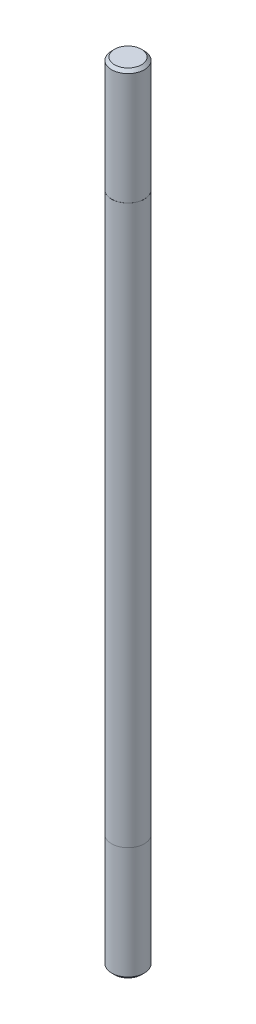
ISO-10303-21;
HEADER;
FILE_DESCRIPTION(('STEP AP214'),'2;1');
FILE_NAME('part.step','',(''),(''),'','','');
FILE_SCHEMA(('AUTOMOTIVE_DESIGN { 1 0 10303 214 1 1 1 1 }'));
ENDSEC;
DATA;
#1=APPLICATION_CONTEXT('core data for automotive mechanical design processes');
#2=APPLICATION_PROTOCOL_DEFINITION('international standard','automotive_design',2000,#1);
#3=PRODUCT_CONTEXT('',#1,'mechanical');
#4=PRODUCT('Part','Part','',(#3));
#5=PRODUCT_RELATED_PRODUCT_CATEGORY('part','',(#4));
#6=PRODUCT_DEFINITION_FORMATION('','',#4);
#7=PRODUCT_DEFINITION_CONTEXT('part definition',#1,'design');
#8=PRODUCT_DEFINITION('design','',#6,#7);
#9=PRODUCT_DEFINITION_SHAPE('','',#8);
#10=(LENGTH_UNIT() NAMED_UNIT(*) SI_UNIT(.MILLI.,.METRE.));
#11=(NAMED_UNIT(*) PLANE_ANGLE_UNIT() SI_UNIT($,.RADIAN.));
#12=(NAMED_UNIT(*) SI_UNIT($,.STERADIAN.) SOLID_ANGLE_UNIT());
#13=UNCERTAINTY_MEASURE_WITH_UNIT(LENGTH_MEASURE(1.E-05),#10,'distance_accuracy_value','');
#14=(GEOMETRIC_REPRESENTATION_CONTEXT(3) GLOBAL_UNCERTAINTY_ASSIGNED_CONTEXT((#13)) GLOBAL_UNIT_ASSIGNED_CONTEXT((#10,
#11,#12)) REPRESENTATION_CONTEXT('',''));
#15=CARTESIAN_POINT('',(0.,0.,0.));
#16=DIRECTION('',(0.,0.,1.));
#17=DIRECTION('',(1.,0.,0.));
#18=AXIS2_PLACEMENT_3D('',#15,#16,#17);
#19=CARTESIAN_POINT('',(0.,0.,0.));
#20=DIRECTION('',(0.,1.,0.));
#21=DIRECTION('',(0.,0.,1.));
#22=AXIS2_PLACEMENT_3D('',#19,#20,#21);
#23=PLANE('',#22);
#24=CARTESIAN_POINT('',(0.,0.,0.));
#25=DIRECTION('',(0.,1.,0.));
#26=DIRECTION('',(0.,0.,1.));
#27=AXIS2_PLACEMENT_3D('',#24,#25,#26);
#28=CIRCLE('',#27,2.);
#29=CARTESIAN_POINT('',(0.,0.,2.));
#30=VERTEX_POINT('',#29);
#31=EDGE_CURVE('E58',#30,#30,#28,.T.);
#32=ORIENTED_EDGE('',*,*,#31,.F.);
#33=EDGE_LOOP('',(#32));
#34=FACE_BOUND('',#33,.T.);
#35=CARTESIAN_POINT('',(0.,0.,0.));
#36=DIRECTION('',(0.,1.,0.));
#37=DIRECTION('',(0.,0.,1.));
#38=AXIS2_PLACEMENT_3D('',#35,#36,#37);
#39=CIRCLE('',#38,1.99);
#40=CARTESIAN_POINT('',(0.,0.,1.99));
#41=VERTEX_POINT('',#40);
#42=EDGE_CURVE('E52',#41,#41,#39,.F.);
#43=ORIENTED_EDGE('',*,*,#42,.F.);
#44=EDGE_LOOP('',(#43));
#45=FACE_BOUND('',#44,.T.);
#46=ADVANCED_FACE('F32',(#34,#45),#23,.F.);
#47=CARTESIAN_POINT('',(0.,68.,0.));
#48=DIRECTION('',(0.,1.,0.));
#49=DIRECTION('',(0.,0.,1.));
#50=AXIS2_PLACEMENT_3D('',#47,#48,#49);
#51=PLANE('',#50);
#52=CARTESIAN_POINT('',(0.,68.,0.));
#53=DIRECTION('',(0.,1.,0.));
#54=DIRECTION('',(0.,0.,1.));
#55=AXIS2_PLACEMENT_3D('',#52,#53,#54);
#56=CIRCLE('',#55,2.);
#57=CARTESIAN_POINT('',(0.,68.,2.));
#58=VERTEX_POINT('',#57);
#59=EDGE_CURVE('E55',#58,#58,#56,.T.);
#60=ORIENTED_EDGE('',*,*,#59,.T.);
#61=EDGE_LOOP('',(#60));
#62=FACE_BOUND('',#61,.T.);
#63=CARTESIAN_POINT('',(0.,68.,0.));
#64=DIRECTION('',(0.,1.,0.));
#65=DIRECTION('',(0.,0.,1.));
#66=AXIS2_PLACEMENT_3D('',#63,#64,#65);
#67=CIRCLE('',#66,1.99);
#68=CARTESIAN_POINT('',(0.,68.,1.99));
#69=VERTEX_POINT('',#68);
#70=EDGE_CURVE('E61',#69,#69,#67,.T.);
#71=ORIENTED_EDGE('',*,*,#70,.F.);
#72=EDGE_LOOP('',(#71));
#73=FACE_BOUND('',#72,.T.);
#74=ADVANCED_FACE('F67',(#62,#73),#51,.T.);
#75=CARTESIAN_POINT('',(0.,68.,0.));
#76=DIRECTION('',(0.,-1.,0.));
#77=DIRECTION('',(0.,0.,-1.));
#78=AXIS2_PLACEMENT_3D('',#75,#76,#77);
#79=CYLINDRICAL_SURFACE('',#78,2.);
#80=ORIENTED_EDGE('',*,*,#59,.F.);
#81=EDGE_LOOP('',(#80));
#82=FACE_BOUND('',#81,.T.);
#83=ORIENTED_EDGE('',*,*,#31,.T.);
#84=EDGE_LOOP('',(#83));
#85=FACE_BOUND('',#84,.T.);
#86=ADVANCED_FACE('F34',(#82,#85),#79,.T.);
#87=CARTESIAN_POINT('',(0.,82.,0.));
#88=DIRECTION('',(0.,-1.,0.));
#89=DIRECTION('',(0.,0.,-1.));
#90=AXIS2_PLACEMENT_3D('',#87,#88,#89);
#91=CYLINDRICAL_SURFACE('',#90,1.99);
#92=CARTESIAN_POINT('',(0.,81.65,0.));
#93=DIRECTION('',(0.,1.,0.));
#94=DIRECTION('',(0.,0.,1.));
#95=AXIS2_PLACEMENT_3D('',#92,#93,#94);
#96=CIRCLE('',#95,1.99);
#97=CARTESIAN_POINT('',(0.,81.65,1.99));
#98=VERTEX_POINT('',#97);
#99=EDGE_CURVE('E10',#98,#98,#96,.F.);
#100=ORIENTED_EDGE('',*,*,#99,.T.);
#101=EDGE_LOOP('',(#100));
#102=FACE_BOUND('',#101,.T.);
#103=ORIENTED_EDGE('',*,*,#70,.T.);
#104=EDGE_LOOP('',(#103));
#105=FACE_BOUND('',#104,.T.);
#106=ADVANCED_FACE('F65',(#102,#105),#91,.T.);
#107=CARTESIAN_POINT('',(0.,82.,0.));
#108=DIRECTION('',(0.,1.,0.));
#109=DIRECTION('',(0.,0.,1.));
#110=AXIS2_PLACEMENT_3D('',#107,#108,#109);
#111=PLANE('',#110);
#112=CARTESIAN_POINT('',(0.,82.,0.));
#113=DIRECTION('',(0.,1.,0.));
#114=DIRECTION('',(0.,0.,1.));
#115=AXIS2_PLACEMENT_3D('',#112,#113,#114);
#116=CIRCLE('',#115,1.64);
#117=CARTESIAN_POINT('',(0.,82.,1.64));
#118=VERTEX_POINT('',#117);
#119=EDGE_CURVE('E39',#118,#118,#116,.T.);
#120=ORIENTED_EDGE('',*,*,#119,.T.);
#121=EDGE_LOOP('',(#120));
#122=FACE_BOUND('',#121,.T.);
#123=ADVANCED_FACE('F80',(#122),#111,.T.);
#124=CARTESIAN_POINT('',(0.,-14.,0.));
#125=DIRECTION('',(0.,1.,0.));
#126=DIRECTION('',(0.,0.,1.));
#127=AXIS2_PLACEMENT_3D('',#124,#125,#126);
#128=CYLINDRICAL_SURFACE('',#127,1.99);
#129=CARTESIAN_POINT('',(0.,-13.65,0.));
#130=DIRECTION('',(0.,-1.,0.));
#131=DIRECTION('',(0.,0.,-1.));
#132=AXIS2_PLACEMENT_3D('',#129,#130,#131);
#133=CIRCLE('',#132,1.99);
#134=CARTESIAN_POINT('',(0.,-13.65,-1.99));
#135=VERTEX_POINT('',#134);
#136=EDGE_CURVE('E43',#135,#135,#133,.F.);
#137=ORIENTED_EDGE('',*,*,#136,.T.);
#138=EDGE_LOOP('',(#137));
#139=FACE_BOUND('',#138,.T.);
#140=ORIENTED_EDGE('',*,*,#42,.T.);
#141=EDGE_LOOP('',(#140));
#142=FACE_BOUND('',#141,.T.);
#143=ADVANCED_FACE('F83',(#139,#142),#128,.T.);
#144=CARTESIAN_POINT('',(0.,-14.,0.));
#145=DIRECTION('',(0.,-1.,0.));
#146=DIRECTION('',(0.,0.,-1.));
#147=AXIS2_PLACEMENT_3D('',#144,#145,#146);
#148=PLANE('',#147);
#149=CARTESIAN_POINT('',(0.,-14.,0.));
#150=DIRECTION('',(0.,-1.,0.));
#151=DIRECTION('',(0.,0.,-1.));
#152=AXIS2_PLACEMENT_3D('',#149,#150,#151);
#153=CIRCLE('',#152,1.63999999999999);
#154=CARTESIAN_POINT('',(0.,-14.,-1.63999999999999));
#155=VERTEX_POINT('',#154);
#156=EDGE_CURVE('E47',#155,#155,#153,.T.);
#157=ORIENTED_EDGE('',*,*,#156,.T.);
#158=EDGE_LOOP('',(#157));
#159=FACE_BOUND('',#158,.T.);
#160=ADVANCED_FACE('F86',(#159),#148,.T.);
#161=CARTESIAN_POINT('',(0.,-14.,0.));
#162=DIRECTION('',(0.,1.,0.));
#163=DIRECTION('',(0.,0.,1.));
#164=AXIS2_PLACEMENT_3D('',#161,#162,#163);
#165=CONICAL_SURFACE('',#164,1.63999999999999,0.785398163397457);
#166=ORIENTED_EDGE('',*,*,#136,.F.);
#167=EDGE_LOOP('',(#166));
#168=FACE_BOUND('',#167,.T.);
#169=ORIENTED_EDGE('',*,*,#156,.F.);
#170=EDGE_LOOP('',(#169));
#171=FACE_BOUND('',#170,.T.);
#172=ADVANCED_FACE('F90',(#168,#171),#165,.T.);
#173=CARTESIAN_POINT('',(0.,82.,0.));
#174=DIRECTION('',(0.,-1.,0.));
#175=DIRECTION('',(0.,0.,-1.));
#176=AXIS2_PLACEMENT_3D('',#173,#174,#175);
#177=CONICAL_SURFACE('',#176,1.64,0.785398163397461);
#178=ORIENTED_EDGE('',*,*,#99,.F.);
#179=EDGE_LOOP('',(#178));
#180=FACE_BOUND('',#179,.T.);
#181=ORIENTED_EDGE('',*,*,#119,.F.);
#182=EDGE_LOOP('',(#181));
#183=FACE_BOUND('',#182,.T.);
#184=ADVANCED_FACE('F94',(#180,#183),#177,.T.);
#185=CLOSED_SHELL('',(#46,#74,#86,#106,#123,#143,#160,#172,#184));
#186=MANIFOLD_SOLID_BREP('B2',#185);
#187=ADVANCED_BREP_SHAPE_REPRESENTATION('',(#18,#186),#14);
#188=SHAPE_DEFINITION_REPRESENTATION(#9,#187);
ENDSEC;
END-ISO-10303-21;
